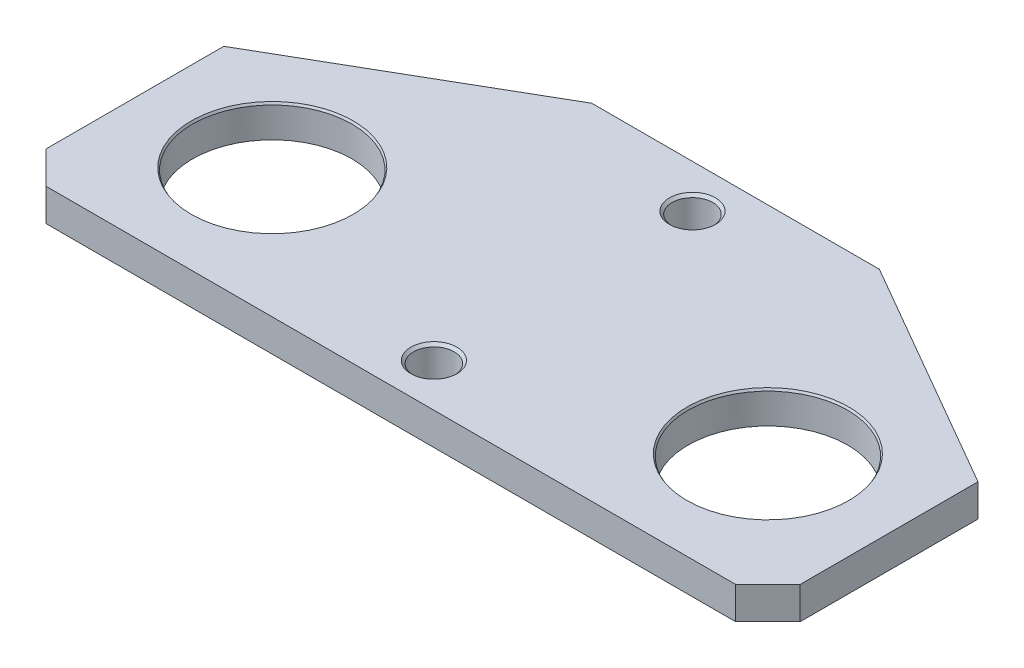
from build123d import *
from OCP.BRepFilletAPI import BRepFilletAPI_MakeChamfer

# Parameters (mm, degrees)
SKETCH1_W           = 222.25
SKETCH1_H           = 101.6
SKETCH1_R           = 23.5
SKETCH1_R_2         = 6
BOSS_EXTRUDE1_DEPTH = 4.7625
CHAMFER1_SIZE       = 9.525
CHAMFER2_SIZE       = 0.635
CHAMFER2_SIZE2      = 0.366617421
CHAMFER4_SIZE       = 39.6875
CHAMFER4_SIZE2      = 68.740766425
CHAMFER5_SIZE       = 0.79375


with BuildPart() as part:
    # Sketch1 → Boss-Extrude1 (new, symmetric)
    with BuildSketch(Plane(origin=(0, 0, 0), x_dir=(1, 0, 0), z_dir=(0, 1, 0))):
        with Locations((0, -38.1)):
            Rectangle(SKETCH1_W, SKETCH1_H)
        with Locations(Location((-73.025, -50.8, 0), (0, 0, 90))):
            Circle(SKETCH1_R, mode=Mode.SUBTRACT)
        with Locations(Location((73.025, -50.8, 0), (0, 0, 90))):
            Circle(SKETCH1_R, mode=Mode.SUBTRACT)
        with Locations(Location((0, 0, 0), (0, 0, 90))):
            Circle(SKETCH1_R_2, mode=Mode.SUBTRACT)
        with Locations(Location((0, -76.2, 0), (0, 0, 90))):
            Circle(SKETCH1_R_2, mode=Mode.SUBTRACT)
    extrude(amount=BOSS_EXTRUDE1_DEPTH, both=True)

    # Chamfer1
    chamfer1_edges = [part.edges().sort_by_distance(p)[0] for p in [
        (111.125, 0, 88.9),
        (-111.125, 0, 88.9),
    ]]
    chamfer(chamfer1_edges, length=CHAMFER1_SIZE)

    # Chamfer2: one chamfer whose edges measure the first distance from different faces: ONE call of the kernel's chamfer builder (chamfer() names one face for all edges)
    chamfer2_edges_1 = [part.edges().sort_by_distance(p)[0] for p in [
        (-73.025, 4.7625, 74.3),
    ]]
    chamfer2_side_1 = [part.faces().sort_by_distance(p)[0] for p in [
        (-73.025, 0, 74.3),
    ]]
    chamfer2_edges_2 = [part.edges().sort_by_distance(p)[0] for p in [
        (73.025, 4.7625, 74.3),
    ]]
    chamfer2_side_2 = [part.faces().sort_by_distance(p)[0] for p in [
        (73.025, 0, 74.3),
    ]]
    chamfer2 = BRepFilletAPI_MakeChamfer(part.part.solid().wrapped)
    for e in chamfer2_edges_1:
        chamfer2.Add(CHAMFER2_SIZE, CHAMFER2_SIZE2, e.wrapped, chamfer2_side_1[0].wrapped)  # the first distance lies on this face
    for e in chamfer2_edges_2:
        chamfer2.Add(CHAMFER2_SIZE, CHAMFER2_SIZE2, e.wrapped, chamfer2_side_2[0].wrapped)  # the first distance lies on this face
    add(Compound.cast(chamfer2.Shape()), mode=Mode.REPLACE)

    # Chamfer4: one chamfer whose edges measure the first distance from different faces: ONE call of the kernel's chamfer builder (chamfer() names one face for all edges)
    chamfer4_edges_1 = [part.edges().sort_by_distance(p)[0] for p in [
        (-111.125, 0, -12.7),
    ]]
    chamfer4_side_1 = [part.faces().sort_by_distance(p)[0] for p in [
        (-111.125, 0, 33.3375),
    ]]
    chamfer4_edges_2 = [part.edges().sort_by_distance(p)[0] for p in [
        (111.125, 0, -12.7),
    ]]
    chamfer4_side_2 = [part.faces().sort_by_distance(p)[0] for p in [
        (111.125, 0, 33.3375),
    ]]
    chamfer4 = BRepFilletAPI_MakeChamfer(part.part.solid().wrapped)
    for e in chamfer4_edges_1:
        chamfer4.Add(CHAMFER4_SIZE, CHAMFER4_SIZE2, e.wrapped, chamfer4_side_1[0].wrapped)  # the first distance lies on this face
    for e in chamfer4_edges_2:
        chamfer4.Add(CHAMFER4_SIZE, CHAMFER4_SIZE2, e.wrapped, chamfer4_side_2[0].wrapped)  # the first distance lies on this face
    add(Compound.cast(chamfer4.Shape()), mode=Mode.REPLACE)

    # Chamfer5
    chamfer5_edges = [part.edges().sort_by_distance(p)[0] for p in [
        (0, 4.7625, 6),
        (0, 4.7625, 82.2),
    ]]
    chamfer(chamfer5_edges, length=CHAMFER5_SIZE)


solid = part.part
